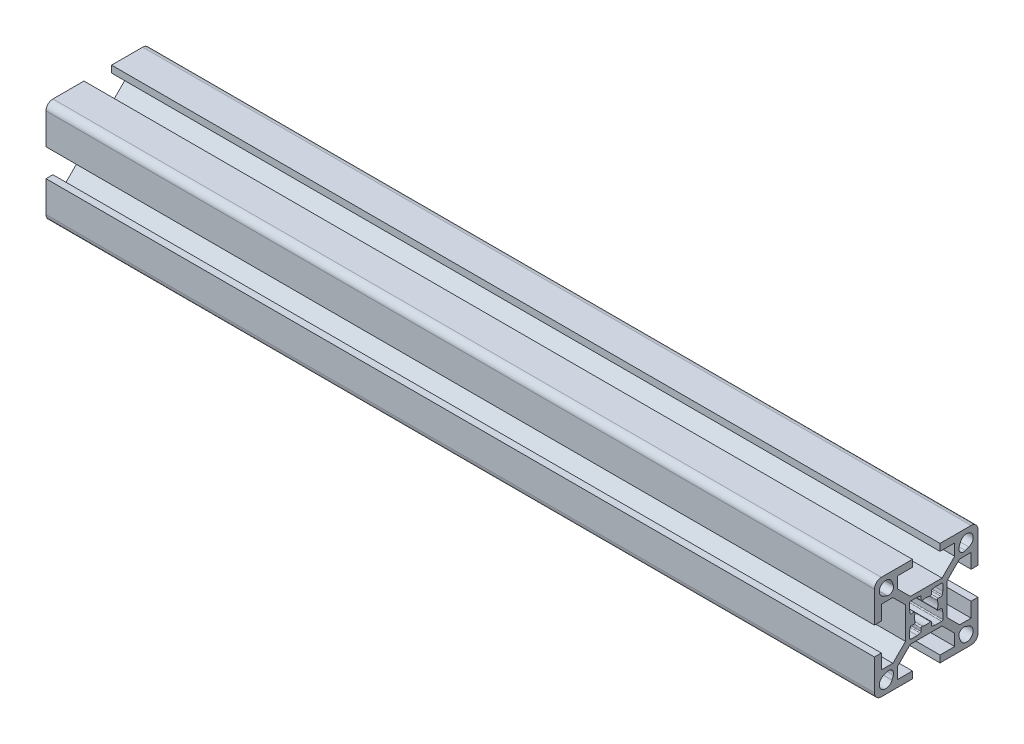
from build123d import *

# Parameters (mm, degrees)
BOSS_EXTRUDE1_DEPTH = 240


with BuildPart() as part:
    # Sketch1 → Boss-Extrude1 (new body)
    with BuildSketch(Plane(origin=(0, 0, 0), x_dir=(0, 0, -1), z_dir=(1, 0, 0))):
        with BuildLine():
            Line((-15, 13), (-15, 4))
            Line((-15, 4), (-13, 4))
            Line((-13, 4), (-13, 8.25))
            Line((-13, 8.25), (-9.664213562, 8.25))
            Line((-9.664213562, 8.25), (-6, 4.585786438))
            Line((-6, 4.585786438), (-6, -4.585786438))
            Line((-6, -4.585786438), (-9.664213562, -8.25))
            Line((-9.664213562, -8.25), (-13, -8.25))
            Line((-13, -8.25), (-13, -4))
            Line((-13, -4), (-15, -4))
            Line((-15, -4), (-15, -13))
            ThreePointArc((-15, -13), (-14.414213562, -14.414213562), (-13, -15))
            Line((-13, -15), (-4, -15))
            Line((-4, -15), (-4, -13))
            Line((-4, -13), (-8.25, -13))
            Line((-8.25, -13), (-8.25, -9.664213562))
            Line((-8.25, -9.664213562), (-4.585786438, -6))
            Line((-4.585786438, -6), (4.585786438, -6))
            Line((4.585786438, -6), (8.25, -9.664213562))
            Line((8.25, -9.664213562), (8.25, -13))
            Line((8.25, -13), (4, -13))
            Line((4, -13), (4, -15))
            Line((4, -15), (13, -15))
            ThreePointArc((13, -15), (14.414213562, -14.414213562), (15, -13))
            Line((15, -13), (15, -4))
            Line((15, -4), (13, -4))
            Line((13, -4), (13, -8.25))
            Line((13, -8.25), (9.664213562, -8.25))
            Line((9.664213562, -8.25), (6, -4.585786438))
            Line((6, -4.585786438), (6, 4.585786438))
            Line((6, 4.585786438), (9.664213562, 8.25))
            Line((9.664213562, 8.25), (13, 8.25))
            Line((13, 8.25), (13, 4))
            Line((13, 4), (15, 4))
            Line((15, 4), (15, 13))
            ThreePointArc((15, 13), (14.414213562, 14.414213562), (13, 15))
            Line((13, 15), (4, 15))
            Line((4, 15), (4, 13))
            Line((4, 13), (8.25, 13))
            Line((8.25, 13), (8.25, 9.664213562))
            Line((8.25, 9.664213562), (4.585786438, 6))
            Line((4.585786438, 6), (-4.585786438, 6))
            Line((-4.585786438, 6), (-8.25, 9.664213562))
            Line((-8.25, 9.664213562), (-8.25, 13))
            Line((-8.25, 13), (-4, 13))
            Line((-4, 13), (-4, 15))
            Line((-4, 15), (-13, 15))
            ThreePointArc((-13, 15), (-14.414213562, 14.414213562), (-15, 13))
        make_face()
        with BuildLine():
            Line((-9.539070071, 11.338915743), (-9.918883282, 12.361530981))
            ThreePointArc((-9.918883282, 12.361530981), (-13.043502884, 13.043502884), (-12.361530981, 9.918883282))
            Line((-12.361530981, 9.918883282), (-11.338915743, 9.539070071))
            ThreePointArc((-11.338915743, 9.539070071), (-9.861522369, 9.861522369), (-9.539070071, 11.338915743))
        make_face(mode=Mode.SUBTRACT)
        with BuildLine():
            Line((9.918883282, 12.361530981), (9.539070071, 11.338915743))
            ThreePointArc((9.539070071, 11.338915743), (9.861522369, 9.861522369), (11.338915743, 9.539070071))
            Line((11.338915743, 9.539070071), (12.361530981, 9.918883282))
            ThreePointArc((12.361530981, 9.918883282), (13.043502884, 13.043502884), (9.918883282, 12.361530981))
        make_face(mode=Mode.SUBTRACT)
        with BuildLine():
            Line((12.361530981, -9.918883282), (11.338915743, -9.539070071))
            ThreePointArc((11.338915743, -9.539070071), (9.861522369, -9.861522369), (9.539070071, -11.338915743))
            Line((9.539070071, -11.338915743), (9.918883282, -12.361530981))
            ThreePointArc((9.918883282, -12.361530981), (13.043502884, -13.043502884), (12.361530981, -9.918883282))
        make_face(mode=Mode.SUBTRACT)
        with BuildLine():
            Line((-11.338915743, -9.539070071), (-12.361530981, -9.918883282))
            ThreePointArc((-12.361530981, -9.918883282), (-13.043502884, -13.043502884), (-9.918883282, -12.361530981))
            Line((-9.918883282, -12.361530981), (-9.539070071, -11.338915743))
            ThreePointArc((-9.539070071, -11.338915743), (-9.861522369, -9.861522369), (-11.338915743, -9.539070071))
        make_face(mode=Mode.SUBTRACT)
        with BuildLine():
            Line((-4.8, -2.644433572), (-4.8, -4.5))
            ThreePointArc((-4.8, -4.5), (-4.712132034, -4.712132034), (-4.5, -4.8))
            Line((-4.5, -4.8), (-2.644433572, -4.8))
            ThreePointArc((-2.644433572, -4.8), (-2.615679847, -4.79861886), (-2.587190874, -4.794488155))
            Line((-2.587190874, -4.794488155), (-1.742757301, -4.630346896))
            ThreePointArc((-1.742757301, -4.630346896), (-1.568512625, -4.526682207), (-1.5, -4.335858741))
            Line((-1.5, -4.335858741), (-1.5, -3.5))
            ThreePointArc((-1.5, -3.5), (-1.374371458, -3.255879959), (-1.102702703, -3.216216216))
            ThreePointArc((-1.102702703, -3.216216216), (0, -3.4), (1.102702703, -3.216216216))
            ThreePointArc((1.102702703, -3.216216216), (1.374371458, -3.255879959), (1.5, -3.5))
            Line((1.5, -3.5), (1.5, -4.335858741))
            ThreePointArc((1.5, -4.335858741), (1.568512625, -4.526682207), (1.742757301, -4.630346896))
            Line((1.742757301, -4.630346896), (2.587190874, -4.794488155))
            ThreePointArc((2.587190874, -4.794488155), (2.615679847, -4.79861886), (2.644433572, -4.8))
            Line((2.644433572, -4.8), (4.5, -4.8))
            ThreePointArc((4.5, -4.8), (4.712132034, -4.712132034), (4.8, -4.5))
            Line((4.8, -4.5), (4.8, -2.644433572))
            ThreePointArc((4.8, -2.644433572), (4.79861886, -2.615679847), (4.794488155, -2.587190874))
            Line((4.794488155, -2.587190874), (4.630346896, -1.742757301))
            ThreePointArc((4.630346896, -1.742757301), (4.526682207, -1.568512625), (4.335858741, -1.5))
            Line((4.335858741, -1.5), (3.5, -1.5))
            ThreePointArc((3.5, -1.5), (3.255879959, -1.374371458), (3.216216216, -1.102702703))
            ThreePointArc((3.216216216, -1.102702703), (3.4, 0), (3.216216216, 1.102702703))
            ThreePointArc((3.216216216, 1.102702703), (3.255879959, 1.374371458), (3.5, 1.5))
            Line((3.5, 1.5), (4.335858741, 1.5))
            ThreePointArc((4.335858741, 1.5), (4.526682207, 1.568512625), (4.630346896, 1.742757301))
            Line((4.630346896, 1.742757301), (4.794488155, 2.587190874))
            ThreePointArc((4.794488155, 2.587190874), (4.79861886, 2.615679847), (4.8, 2.644433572))
            Line((4.8, 2.644433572), (4.8, 4.5))
            ThreePointArc((4.8, 4.5), (4.712132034, 4.712132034), (4.5, 4.8))
            Line((4.5, 4.8), (2.644433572, 4.8))
            ThreePointArc((2.644433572, 4.8), (2.615679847, 4.79861886), (2.587190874, 4.794488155))
            Line((2.587190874, 4.794488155), (1.742757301, 4.630346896))
            ThreePointArc((1.742757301, 4.630346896), (1.568512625, 4.526682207), (1.5, 4.335858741))
            Line((1.5, 4.335858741), (1.5, 3.5))
            ThreePointArc((1.5, 3.5), (1.374371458, 3.255879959), (1.102702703, 3.216216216))
            ThreePointArc((1.102702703, 3.216216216), (0, 3.4), (-1.102702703, 3.216216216))
            ThreePointArc((-1.102702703, 3.216216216), (-1.374371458, 3.255879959), (-1.5, 3.5))
            Line((-1.5, 3.5), (-1.5, 4.335858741))
            ThreePointArc((-1.5, 4.335858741), (-1.568512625, 4.526682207), (-1.742757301, 4.630346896))
            Line((-1.742757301, 4.630346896), (-2.587190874, 4.794488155))
            ThreePointArc((-2.587190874, 4.794488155), (-2.615679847, 4.79861886), (-2.644433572, 4.8))
            Line((-2.644433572, 4.8), (-4.5, 4.8))
            ThreePointArc((-4.5, 4.8), (-4.712132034, 4.712132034), (-4.8, 4.5))
            Line((-4.8, 4.5), (-4.8, 2.644433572))
            ThreePointArc((-4.8, 2.644433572), (-4.79861886, 2.615679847), (-4.794488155, 2.587190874))
            Line((-4.794488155, 2.587190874), (-4.630346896, 1.742757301))
            ThreePointArc((-4.630346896, 1.742757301), (-4.526682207, 1.568512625), (-4.335858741, 1.5))
            Line((-4.335858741, 1.5), (-3.5, 1.5))
            ThreePointArc((-3.5, 1.5), (-3.255879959, 1.374371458), (-3.216216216, 1.102702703))
            ThreePointArc((-3.216216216, 1.102702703), (-3.4, 0), (-3.216216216, -1.102702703))
            ThreePointArc((-3.216216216, -1.102702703), (-3.255879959, -1.374371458), (-3.5, -1.5))
            Line((-3.5, -1.5), (-4.335858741, -1.5))
            ThreePointArc((-4.335858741, -1.5), (-4.526682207, -1.568512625), (-4.630346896, -1.742757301))
            Line((-4.630346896, -1.742757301), (-4.794488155, -2.587190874))
            ThreePointArc((-4.794488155, -2.587190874), (-4.79861886, -2.615679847), (-4.8, -2.644433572))
        make_face(mode=Mode.SUBTRACT)
    extrude(amount=BOSS_EXTRUDE1_DEPTH)


solid = part.part
